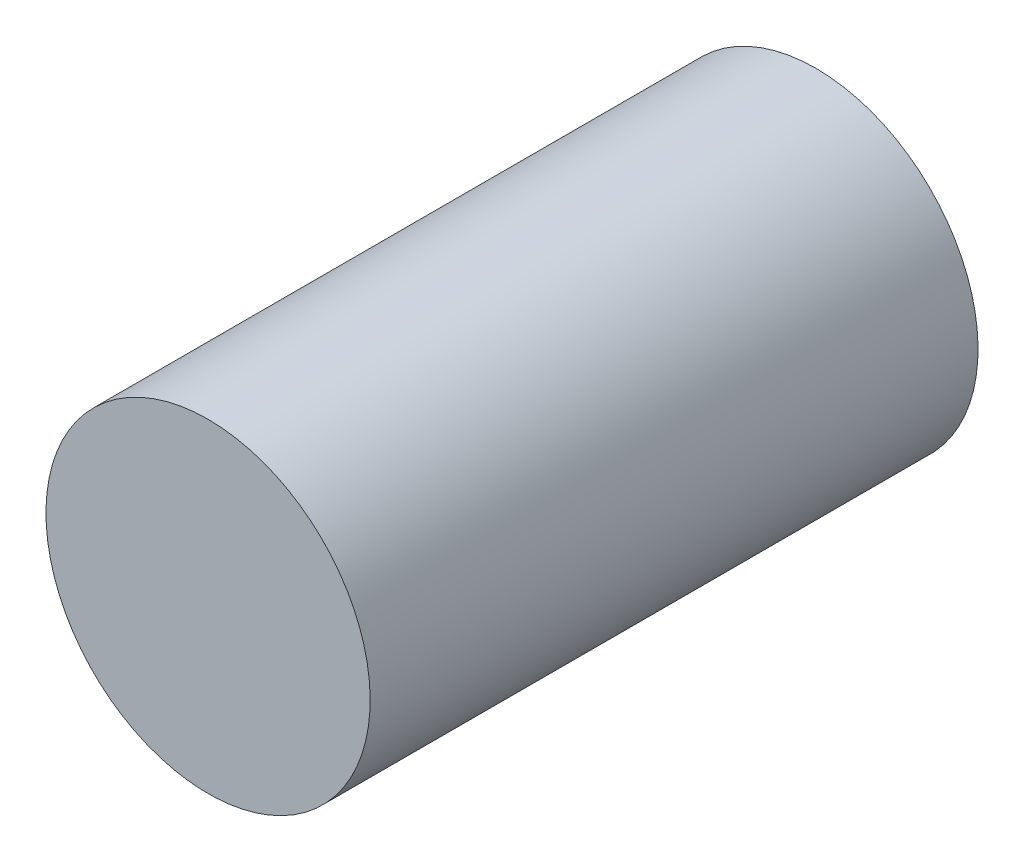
ISO-10303-21;
HEADER;
FILE_DESCRIPTION(('STEP AP214'),'2;1');
FILE_NAME('part.step','',(''),(''),'','','');
FILE_SCHEMA(('AUTOMOTIVE_DESIGN { 1 0 10303 214 1 1 1 1 }'));
ENDSEC;
DATA;
#1=APPLICATION_CONTEXT('core data for automotive mechanical design processes');
#2=APPLICATION_PROTOCOL_DEFINITION('international standard','automotive_design',2000,#1);
#3=PRODUCT_CONTEXT('',#1,'mechanical');
#4=PRODUCT('Part','Part','',(#3));
#5=PRODUCT_RELATED_PRODUCT_CATEGORY('part','',(#4));
#6=PRODUCT_DEFINITION_FORMATION('','',#4);
#7=PRODUCT_DEFINITION_CONTEXT('part definition',#1,'design');
#8=PRODUCT_DEFINITION('design','',#6,#7);
#9=PRODUCT_DEFINITION_SHAPE('','',#8);
#10=(LENGTH_UNIT() NAMED_UNIT(*) SI_UNIT(.MILLI.,.METRE.));
#11=(NAMED_UNIT(*) PLANE_ANGLE_UNIT() SI_UNIT($,.RADIAN.));
#12=(NAMED_UNIT(*) SI_UNIT($,.STERADIAN.) SOLID_ANGLE_UNIT());
#13=UNCERTAINTY_MEASURE_WITH_UNIT(LENGTH_MEASURE(1.E-05),#10,'distance_accuracy_value','');
#14=(GEOMETRIC_REPRESENTATION_CONTEXT(3) GLOBAL_UNCERTAINTY_ASSIGNED_CONTEXT((#13)) GLOBAL_UNIT_ASSIGNED_CONTEXT((#10,
#11,#12)) REPRESENTATION_CONTEXT('',''));
#15=CARTESIAN_POINT('',(0.,0.,0.));
#16=DIRECTION('',(0.,0.,1.));
#17=DIRECTION('',(1.,0.,0.));
#18=AXIS2_PLACEMENT_3D('',#15,#16,#17);
#19=CARTESIAN_POINT('',(29.048,17.952,90.));
#20=DIRECTION('',(0.,0.,-1.));
#21=DIRECTION('',(-1.,0.,0.));
#22=AXIS2_PLACEMENT_3D('',#19,#20,#21);
#23=PLANE('',#22);
#24=CARTESIAN_POINT('',(25.,22.,90.));
#25=DIRECTION('',(0.,0.,-1.));
#26=DIRECTION('',(0.,1.,0.));
#27=AXIS2_PLACEMENT_3D('',#24,#25,#26);
#28=CIRCLE('',#27,4.);
#29=CARTESIAN_POINT('',(25.,26.,90.));
#30=VERTEX_POINT('',#29);
#31=EDGE_CURVE('E26',#30,#30,#28,.T.);
#32=ORIENTED_EDGE('',*,*,#31,.T.);
#33=EDGE_LOOP('',(#32));
#34=FACE_BOUND('',#33,.T.);
#35=ADVANCED_FACE('F22',(#34),#23,.T.);
#36=CARTESIAN_POINT('',(20.952,17.952,105.));
#37=DIRECTION('',(0.,0.,1.));
#38=DIRECTION('',(1.,0.,0.));
#39=AXIS2_PLACEMENT_3D('',#36,#37,#38);
#40=PLANE('',#39);
#41=CARTESIAN_POINT('',(25.,22.,105.));
#42=DIRECTION('',(0.,0.,-1.));
#43=DIRECTION('',(0.,1.,0.));
#44=AXIS2_PLACEMENT_3D('',#41,#42,#43);
#45=CIRCLE('',#44,4.);
#46=CARTESIAN_POINT('',(25.,26.,105.));
#47=VERTEX_POINT('',#46);
#48=EDGE_CURVE('E12',#47,#47,#45,.F.);
#49=ORIENTED_EDGE('',*,*,#48,.T.);
#50=EDGE_LOOP('',(#49));
#51=FACE_BOUND('',#50,.T.);
#52=ADVANCED_FACE('F24',(#51),#40,.T.);
#53=CARTESIAN_POINT('',(25.,22.,105.));
#54=DIRECTION('',(0.,0.,-1.));
#55=DIRECTION('',(0.,1.,0.));
#56=AXIS2_PLACEMENT_3D('',#53,#54,#55);
#57=CYLINDRICAL_SURFACE('',#56,4.);
#58=ORIENTED_EDGE('',*,*,#31,.F.);
#59=EDGE_LOOP('',(#58));
#60=FACE_BOUND('',#59,.T.);
#61=ORIENTED_EDGE('',*,*,#48,.F.);
#62=EDGE_LOOP('',(#61));
#63=FACE_BOUND('',#62,.T.);
#64=ADVANCED_FACE('F36',(#60,#63),#57,.T.);
#65=CLOSED_SHELL('',(#35,#52,#64));
#66=MANIFOLD_SOLID_BREP('B1',#65);
#67=ADVANCED_BREP_SHAPE_REPRESENTATION('',(#18,#66),#14);
#68=SHAPE_DEFINITION_REPRESENTATION(#9,#67);
ENDSEC;
END-ISO-10303-21;
